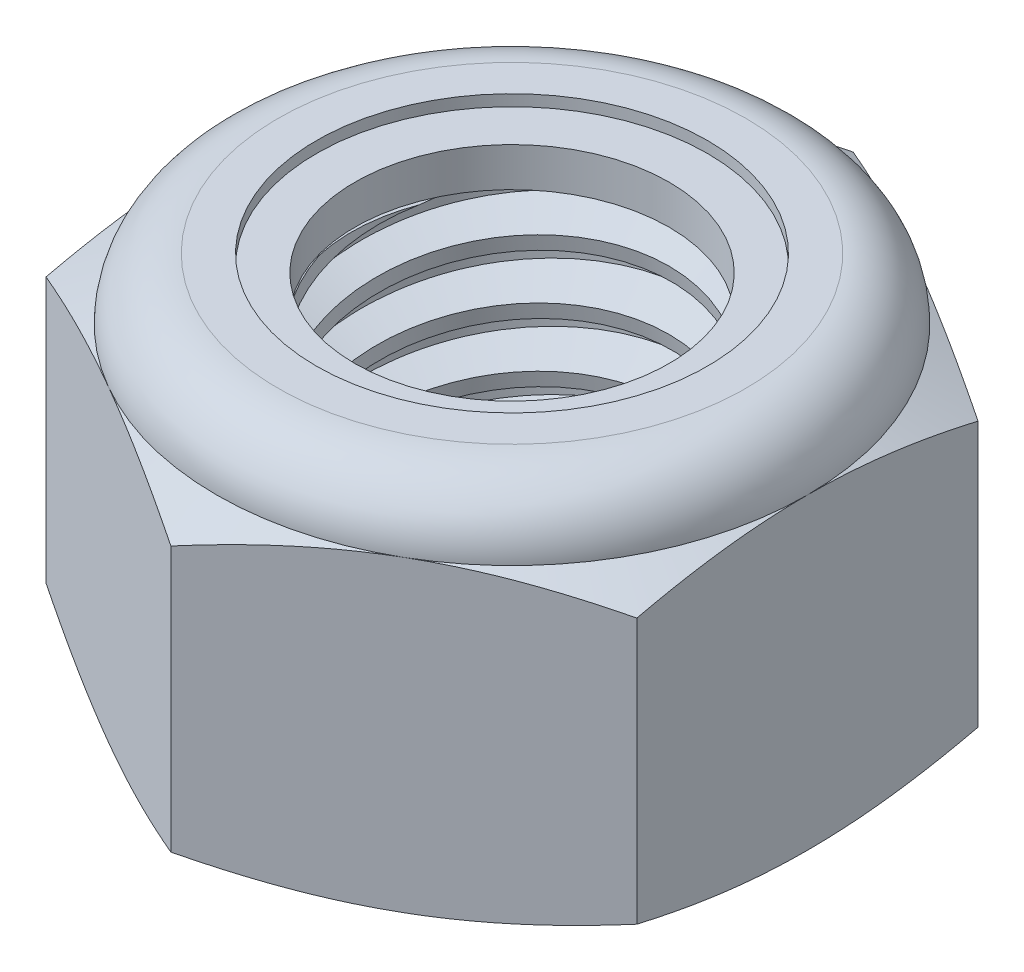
from build123d import *

# Parameters (mm, degrees)
EXTRUDE1_DEPTH      = 5
SKETCH2_W           = 2.5
SKETCH2_H           = 5
LPATTERN1_COUNT     = 6
LPATTERN1_PITCH     = 0.8
LPATTERN1_COL_COUNT = 2
LPATTERN1_COL_PITCH = 0.8


with BuildPart() as part:
    # Sketch1 → Extrude1 (new body)
    with BuildSketch(Plane(origin=(0, 0, 0), x_dir=(1, 0, 0), z_dir=(0, 1, 0))):
        Polygon((0, 4.618802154), (-4, 2.309401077), (-4, -2.309401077), (0, -4.618802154), (4, -2.309401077), (4, 2.309401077), align=None)
    extrude(amount=EXTRUDE1_DEPTH)

    # Sketch4 → Cut-Revolve2 (revolve, cut)
    with BuildSketch(Plane(origin=(0, 0, 0), x_dir=(0, 0, -1), z_dir=(1, 0, 0)), mode=Mode.PRIVATE) as cut_revolve2_sk:
        Polygon((0, 5), (2.5, 5), (2.127722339, 4.826404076), (2.127722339, 0.173595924), (2.5, 0), (0, 0), align=None)
    revolve(cut_revolve2_sk.sketch.rotate(Axis((0, 5, 0), (0, 1, 0)), 55.091745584), axis=Axis((0, 5, 0), (0, 1, 0)), mode=Mode.SUBTRACT)


with BuildPart() as body_2:
    # Sketch2 → Revolve1 (revolve)
    with BuildSketch(Plane(origin=(0, 0, 0), x_dir=(0, 0, -1), z_dir=(1, 0, 0))):
        with Locations((1.25, 2.5)):
            Rectangle(SKETCH2_W, SKETCH2_H)
    revolve(axis=Axis((0, -2.5, 0), (0, 1, 0)))

    # Sketch3 → Cut-Revolve1 (revolve, cut)
    with BuildSketch(Plane(origin=(0, 0, 0), x_dir=(0, 0, -1), z_dir=(1, 0, 0)), mode=Mode.PRIVATE) as cut_revolve1_sk:
        Polygon((2.51579905, 4.901255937), (2.626392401, 4.210047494), (2.15932044, 4.388495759), (2.127722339, 4.585983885), align=None)
    cut_revolve1 = revolve(cut_revolve1_sk.sketch.rotate(Axis((0, 5, 0.136915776), (0, -0.9874406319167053, -0.1579905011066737)), 180), axis=Axis((0, 5, 0.136915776), (0, -0.9874406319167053, -0.1579905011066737)), mode=Mode.SUBTRACT)

    # LPattern1: Cut-Revolve1 ×6
    with Locations(*[(0, -i * LPATTERN1_PITCH, 0) for i in range(1, LPATTERN1_COUNT)]):
        add(cut_revolve1, mode=Mode.SUBTRACT)

    # LPattern1 col: Cut-Revolve1 ×2
    with Locations(*[(0, i * LPATTERN1_COL_PITCH, 0) for i in range(1, LPATTERN1_COL_COUNT)]):
        add(cut_revolve1, mode=Mode.SUBTRACT)


with BuildPart() as part_1:
    add(part.part)

    # Combine1: cut body 2
    add(body_2.part, mode=Mode.SUBTRACT)

    # Sketch5 → Cut-Revolve3 (revolve, cut)
    with BuildSketch(Plane(origin=(0, 0, 0), x_dir=(0, 0, -1), z_dir=(1, 0, 0)), mode=Mode.PRIVATE) as cut_revolve3_sk:
        with BuildLine():
            Line((0, 0), (4, 0))
            Line((4, 0), (4.618802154, 0.288552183))
            Line((4.618802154, 0.288552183), (4.618802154, 3.878114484))
            Line((4.618802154, 3.878114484), (4, 4.166666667))
            ThreePointArc((4, 4.166666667), (3.755922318, 4.755922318), (3.166666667, 5))
            Line((3.166666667, 5), (3.166666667, 6.27))
            Line((3.166666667, 6.27), (5.888802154, 6.27))
            Line((5.888802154, 6.27), (5.888802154, -1.27))
            Line((5.888802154, -1.27), (0, -1.27))
            Line((0, -1.27), (0, 0))
        make_face()
    revolve(cut_revolve3_sk.sketch.rotate(Axis((0, 0, 0), (0, 1, 0)), 55.091745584), axis=Axis((0, 0, 0), (0, 1, 0)), mode=Mode.SUBTRACT)

    # Sketch6 → Cut-Revolve4 (revolve, cut)
    with BuildSketch(Plane(origin=(0, 0, 0), x_dir=(0, 0, -1), z_dir=(1, 0, 0)), mode=Mode.PRIVATE) as cut_revolve4_sk:
        with BuildLine():
            Line((0, 4.166666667), (3.8476, 4.166666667))
            ThreePointArc((3.8476, 4.166666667), (3.648159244, 4.648159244), (3.166666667, 4.8476))
            Line((3.166666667, 4.8476), (2.647194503, 4.8476))
            Line((2.647194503, 4.8476), (2.647194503, 6.27))
            Line((2.647194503, 6.27), (0, 6.27))
            Line((0, 6.27), (0, 4.166666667))
        make_face()
    revolve(cut_revolve4_sk.sketch.rotate(Axis((0, 6.27, 0), (0, 1, 0)), 55.091745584), axis=Axis((0, 6.27, 0), (0, 1, 0)), mode=Mode.SUBTRACT)


with BuildPart() as body_2_2:
    # Sketch7 → Revolve2 (revolve)
    with BuildSketch(Plane(origin=(0, 0, 0), x_dir=(0, 0, -1), z_dir=(1, 0, 0))):
        with BuildLine():
            Line((2.127722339, 4.242866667), (3.766579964, 4.242866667))
            ThreePointArc((3.766579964, 4.242866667), (3.566430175, 4.620419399), (3.166666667, 4.7714))
            Line((3.166666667, 4.7714), (2.127722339, 4.7714))
            Line((2.127722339, 4.7714), (2.127722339, 4.242866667))
        make_face()
    revolve(axis=Axis((0, 4.242866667, 0), (0, 1, 0)))


solid = Compound([part_1.part, body_2_2.part])
